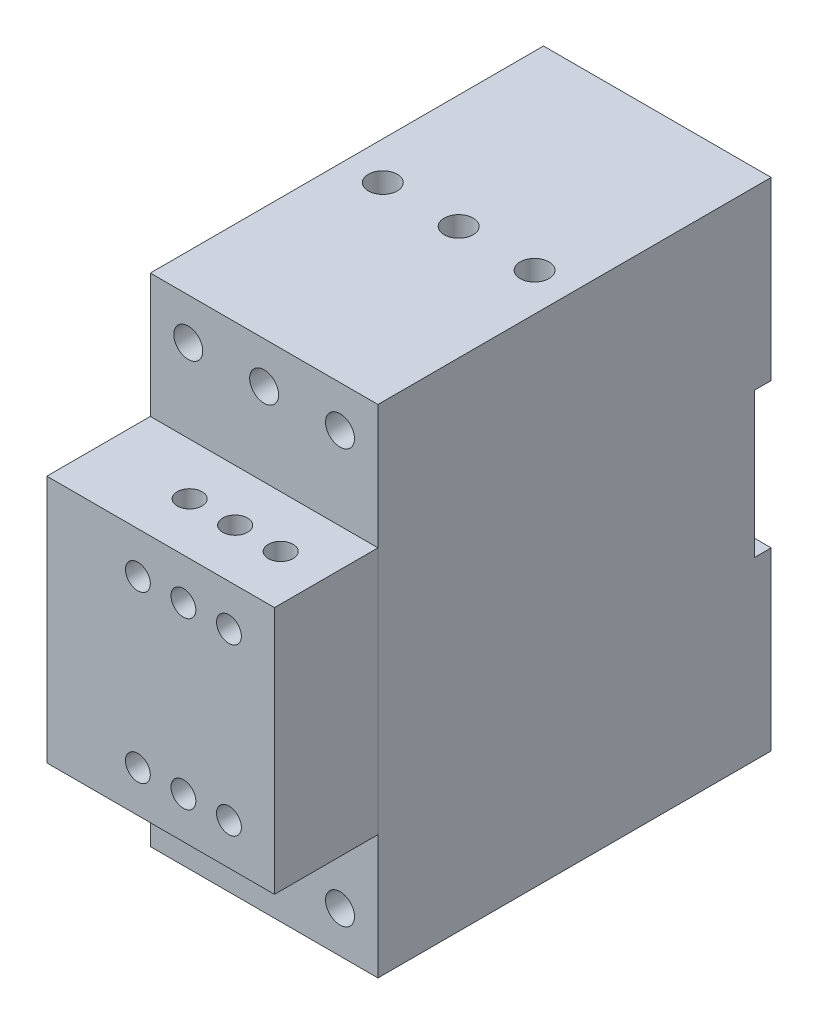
ISO-10303-21;
HEADER;
FILE_DESCRIPTION(('STEP AP214'),'2;1');
FILE_NAME('part.step','',(''),(''),'','','');
FILE_SCHEMA(('AUTOMOTIVE_DESIGN { 1 0 10303 214 1 1 1 1 }'));
ENDSEC;
DATA;
#1=APPLICATION_CONTEXT('core data for automotive mechanical design processes');
#2=APPLICATION_PROTOCOL_DEFINITION('international standard','automotive_design',2000,#1);
#3=PRODUCT_CONTEXT('',#1,'mechanical');
#4=PRODUCT('Part','Part','',(#3));
#5=PRODUCT_RELATED_PRODUCT_CATEGORY('part','',(#4));
#6=PRODUCT_DEFINITION_FORMATION('','',#4);
#7=PRODUCT_DEFINITION_CONTEXT('part definition',#1,'design');
#8=PRODUCT_DEFINITION('design','',#6,#7);
#9=PRODUCT_DEFINITION_SHAPE('','',#8);
#10=(LENGTH_UNIT() NAMED_UNIT(*) SI_UNIT(.MILLI.,.METRE.));
#11=(NAMED_UNIT(*) PLANE_ANGLE_UNIT() SI_UNIT($,.RADIAN.));
#12=(NAMED_UNIT(*) SI_UNIT($,.STERADIAN.) SOLID_ANGLE_UNIT());
#13=UNCERTAINTY_MEASURE_WITH_UNIT(LENGTH_MEASURE(1.E-05),#10,'distance_accuracy_value','');
#14=(GEOMETRIC_REPRESENTATION_CONTEXT(3) GLOBAL_UNCERTAINTY_ASSIGNED_CONTEXT((#13)) GLOBAL_UNIT_ASSIGNED_CONTEXT((#10,
#11,#12)) REPRESENTATION_CONTEXT('',''));
#15=CARTESIAN_POINT('',(0.,0.,0.));
#16=DIRECTION('',(0.,0.,1.));
#17=DIRECTION('',(1.,0.,0.));
#18=AXIS2_PLACEMENT_3D('',#15,#16,#17);
#19=CARTESIAN_POINT('',(0.,30.,91.));
#20=DIRECTION('',(0.,0.,1.));
#21=DIRECTION('',(1.,0.,0.));
#22=AXIS2_PLACEMENT_3D('',#19,#20,#21);
#23=PLANE('',#22);
#24=DIRECTION('',(-1.,0.,0.));
#25=VECTOR('',#24,1.);
#26=CARTESIAN_POINT('',(55.,-60.,91.));
#27=LINE('',#26,#25);
#28=CARTESIAN_POINT('',(55.,-60.,91.));
#29=VERTEX_POINT('',#28);
#30=CARTESIAN_POINT('',(0.,-60.,91.));
#31=VERTEX_POINT('',#30);
#32=EDGE_CURVE('E610',#29,#31,#27,.T.);
#33=ORIENTED_EDGE('',*,*,#32,.F.);
#34=DIRECTION('',(0.,-1.,0.));
#35=VECTOR('',#34,1.);
#36=CARTESIAN_POINT('',(55.,60.,91.));
#37=LINE('',#36,#35);
#38=CARTESIAN_POINT('',(55.,60.,91.));
#39=VERTEX_POINT('',#38);
#40=EDGE_CURVE('E159',#39,#29,#37,.T.);
#41=ORIENTED_EDGE('',*,*,#40,.F.);
#42=DIRECTION('',(-1.,0.,0.));
#43=VECTOR('',#42,1.);
#44=CARTESIAN_POINT('',(55.,60.,91.));
#45=LINE('',#44,#43);
#46=CARTESIAN_POINT('',(0.,60.,91.));
#47=VERTEX_POINT('',#46);
#48=EDGE_CURVE('E137',#39,#47,#45,.T.);
#49=ORIENTED_EDGE('',*,*,#48,.T.);
#50=DIRECTION('',(0.,-1.,0.));
#51=VECTOR('',#50,1.);
#52=CARTESIAN_POINT('',(0.,60.,91.));
#53=LINE('',#52,#51);
#54=EDGE_CURVE('E141',#47,#31,#53,.T.);
#55=ORIENTED_EDGE('',*,*,#54,.T.);
#56=EDGE_LOOP('',(#33,#41,#49,#55));
#57=FACE_BOUND('',#56,.T.);
#58=CARTESIAN_POINT('',(27.5,-50.,91.));
#59=DIRECTION('',(0.,0.,-1.));
#60=DIRECTION('',(1.,0.,0.));
#61=AXIS2_PLACEMENT_3D('',#58,#59,#60);
#62=CIRCLE('',#61,3.5);
#63=CARTESIAN_POINT('',(31.,-50.,91.));
#64=VERTEX_POINT('',#63);
#65=EDGE_CURVE('E209',#64,#64,#62,.T.);
#66=ORIENTED_EDGE('',*,*,#65,.T.);
#67=EDGE_LOOP('',(#66));
#68=FACE_BOUND('',#67,.T.);
#69=CARTESIAN_POINT('',(45.8333333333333,-50.,91.));
#70=DIRECTION('',(0.,0.,-1.));
#71=DIRECTION('',(1.,0.,0.));
#72=AXIS2_PLACEMENT_3D('',#69,#70,#71);
#73=CIRCLE('',#72,3.5);
#74=CARTESIAN_POINT('',(49.3333333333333,-50.,91.));
#75=VERTEX_POINT('',#74);
#76=EDGE_CURVE('E203',#75,#75,#73,.T.);
#77=ORIENTED_EDGE('',*,*,#76,.T.);
#78=EDGE_LOOP('',(#77));
#79=FACE_BOUND('',#78,.T.);
#80=CARTESIAN_POINT('',(9.16666666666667,-50.,91.));
#81=DIRECTION('',(0.,0.,-1.));
#82=DIRECTION('',(1.,0.,0.));
#83=AXIS2_PLACEMENT_3D('',#80,#81,#82);
#84=CIRCLE('',#83,3.50000000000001);
#85=CARTESIAN_POINT('',(12.6666666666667,-50.,91.));
#86=VERTEX_POINT('',#85);
#87=EDGE_CURVE('E215',#86,#86,#84,.T.);
#88=ORIENTED_EDGE('',*,*,#87,.T.);
#89=EDGE_LOOP('',(#88));
#90=FACE_BOUND('',#89,.T.);
#91=CARTESIAN_POINT('',(9.16666666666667,50.,91.));
#92=DIRECTION('',(0.,0.,1.));
#93=DIRECTION('',(1.,0.,0.));
#94=AXIS2_PLACEMENT_3D('',#91,#92,#93);
#95=CIRCLE('',#94,3.50000000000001);
#96=CARTESIAN_POINT('',(12.6666666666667,50.,91.));
#97=VERTEX_POINT('',#96);
#98=EDGE_CURVE('E179',#97,#97,#95,.T.);
#99=ORIENTED_EDGE('',*,*,#98,.F.);
#100=EDGE_LOOP('',(#99));
#101=FACE_BOUND('',#100,.T.);
#102=CARTESIAN_POINT('',(27.5,50.,91.));
#103=DIRECTION('',(0.,0.,1.));
#104=DIRECTION('',(1.,0.,0.));
#105=AXIS2_PLACEMENT_3D('',#102,#103,#104);
#106=CIRCLE('',#105,3.5);
#107=CARTESIAN_POINT('',(31.,50.,91.));
#108=VERTEX_POINT('',#107);
#109=EDGE_CURVE('E173',#108,#108,#106,.T.);
#110=ORIENTED_EDGE('',*,*,#109,.F.);
#111=EDGE_LOOP('',(#110));
#112=FACE_BOUND('',#111,.T.);
#113=CARTESIAN_POINT('',(45.8333333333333,50.,91.));
#114=DIRECTION('',(0.,0.,1.));
#115=DIRECTION('',(1.,0.,0.));
#116=AXIS2_PLACEMENT_3D('',#113,#114,#115);
#117=CIRCLE('',#116,3.5);
#118=CARTESIAN_POINT('',(49.3333333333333,50.,91.));
#119=VERTEX_POINT('',#118);
#120=EDGE_CURVE('E167',#119,#119,#117,.T.);
#121=ORIENTED_EDGE('',*,*,#120,.F.);
#122=EDGE_LOOP('',(#121));
#123=FACE_BOUND('',#122,.T.);
#124=ADVANCED_FACE('F49',(#57,#68,#79,#90,#101,#112,#123),#23,.T.);
#125=CARTESIAN_POINT('',(9.16666666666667,50.,86.));
#126=DIRECTION('',(0.,0.,1.));
#127=DIRECTION('',(1.,0.,0.));
#128=AXIS2_PLACEMENT_3D('',#125,#126,#127);
#129=PLANE('',#128);
#130=CARTESIAN_POINT('',(9.16666666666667,50.,86.));
#131=DIRECTION('',(0.,0.,1.));
#132=DIRECTION('',(1.,0.,0.));
#133=AXIS2_PLACEMENT_3D('',#130,#131,#132);
#134=CIRCLE('',#133,3.50000000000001);
#135=CARTESIAN_POINT('',(12.6666666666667,50.,86.));
#136=VERTEX_POINT('',#135);
#137=EDGE_CURVE('E176',#136,#136,#134,.T.);
#138=ORIENTED_EDGE('',*,*,#137,.T.);
#139=EDGE_LOOP('',(#138));
#140=FACE_BOUND('',#139,.T.);
#141=ADVANCED_FACE('F290',(#140),#129,.T.);
#142=CARTESIAN_POINT('',(9.16666666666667,50.,86.));
#143=DIRECTION('',(0.,0.,1.));
#144=DIRECTION('',(1.,0.,0.));
#145=AXIS2_PLACEMENT_3D('',#142,#143,#144);
#146=CYLINDRICAL_SURFACE('',#145,3.50000000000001);
#147=ORIENTED_EDGE('',*,*,#137,.F.);
#148=EDGE_LOOP('',(#147));
#149=FACE_BOUND('',#148,.T.);
#150=ORIENTED_EDGE('',*,*,#98,.T.);
#151=EDGE_LOOP('',(#150));
#152=FACE_BOUND('',#151,.T.);
#153=ADVANCED_FACE('F361',(#149,#152),#146,.F.);
#154=CARTESIAN_POINT('',(27.5,50.,86.));
#155=DIRECTION('',(0.,0.,1.));
#156=DIRECTION('',(1.,0.,0.));
#157=AXIS2_PLACEMENT_3D('',#154,#155,#156);
#158=PLANE('',#157);
#159=CARTESIAN_POINT('',(27.5,50.,86.));
#160=DIRECTION('',(0.,0.,1.));
#161=DIRECTION('',(1.,0.,0.));
#162=AXIS2_PLACEMENT_3D('',#159,#160,#161);
#163=CIRCLE('',#162,3.5);
#164=CARTESIAN_POINT('',(31.,50.,86.));
#165=VERTEX_POINT('',#164);
#166=EDGE_CURVE('E170',#165,#165,#163,.T.);
#167=ORIENTED_EDGE('',*,*,#166,.T.);
#168=EDGE_LOOP('',(#167));
#169=FACE_BOUND('',#168,.T.);
#170=ADVANCED_FACE('F358',(#169),#158,.T.);
#171=CARTESIAN_POINT('',(27.5,50.,86.));
#172=DIRECTION('',(0.,0.,1.));
#173=DIRECTION('',(1.,0.,0.));
#174=AXIS2_PLACEMENT_3D('',#171,#172,#173);
#175=CYLINDRICAL_SURFACE('',#174,3.5);
#176=ORIENTED_EDGE('',*,*,#166,.F.);
#177=EDGE_LOOP('',(#176));
#178=FACE_BOUND('',#177,.T.);
#179=ORIENTED_EDGE('',*,*,#109,.T.);
#180=EDGE_LOOP('',(#179));
#181=FACE_BOUND('',#180,.T.);
#182=ADVANCED_FACE('F348',(#178,#181),#175,.F.);
#183=CARTESIAN_POINT('',(45.8333333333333,50.,86.));
#184=DIRECTION('',(0.,0.,1.));
#185=DIRECTION('',(1.,0.,0.));
#186=AXIS2_PLACEMENT_3D('',#183,#184,#185);
#187=PLANE('',#186);
#188=CARTESIAN_POINT('',(45.8333333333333,50.,86.));
#189=DIRECTION('',(0.,0.,1.));
#190=DIRECTION('',(1.,0.,0.));
#191=AXIS2_PLACEMENT_3D('',#188,#189,#190);
#192=CIRCLE('',#191,3.5);
#193=CARTESIAN_POINT('',(49.3333333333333,50.,86.));
#194=VERTEX_POINT('',#193);
#195=EDGE_CURVE('E151',#194,#194,#192,.T.);
#196=ORIENTED_EDGE('',*,*,#195,.T.);
#197=EDGE_LOOP('',(#196));
#198=FACE_BOUND('',#197,.T.);
#199=ADVANCED_FACE('F339',(#198),#187,.T.);
#200=CARTESIAN_POINT('',(45.8333333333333,50.,86.));
#201=DIRECTION('',(0.,0.,1.));
#202=DIRECTION('',(1.,0.,0.));
#203=AXIS2_PLACEMENT_3D('',#200,#201,#202);
#204=CYLINDRICAL_SURFACE('',#203,3.5);
#205=ORIENTED_EDGE('',*,*,#195,.F.);
#206=EDGE_LOOP('',(#205));
#207=FACE_BOUND('',#206,.T.);
#208=ORIENTED_EDGE('',*,*,#120,.T.);
#209=EDGE_LOOP('',(#208));
#210=FACE_BOUND('',#209,.T.);
#211=ADVANCED_FACE('F337',(#207,#210),#204,.F.);
#212=CARTESIAN_POINT('',(45.8333333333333,-55.,44.));
#213=DIRECTION('',(0.,-1.,0.));
#214=DIRECTION('',(0.,0.,1.));
#215=AXIS2_PLACEMENT_3D('',#212,#213,#214);
#216=PLANE('',#215);
#217=CARTESIAN_POINT('',(45.8333333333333,-55.,44.));
#218=DIRECTION('',(0.,1.,0.));
#219=DIRECTION('',(0.,0.,1.));
#220=AXIS2_PLACEMENT_3D('',#217,#218,#219);
#221=CIRCLE('',#220,3.5);
#222=CARTESIAN_POINT('',(45.8333333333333,-55.,47.5));
#223=VERTEX_POINT('',#222);
#224=EDGE_CURVE('E53',#223,#223,#221,.T.);
#225=ORIENTED_EDGE('',*,*,#224,.F.);
#226=EDGE_LOOP('',(#225));
#227=FACE_BOUND('',#226,.T.);
#228=ADVANCED_FACE('F248',(#227),#216,.T.);
#229=CARTESIAN_POINT('',(9.16666666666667,-55.,44.));
#230=DIRECTION('',(0.,-1.,0.));
#231=DIRECTION('',(0.,0.,1.));
#232=AXIS2_PLACEMENT_3D('',#229,#230,#231);
#233=PLANE('',#232);
#234=CARTESIAN_POINT('',(9.16666666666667,-55.,44.));
#235=DIRECTION('',(0.,1.,0.));
#236=DIRECTION('',(0.,0.,1.));
#237=AXIS2_PLACEMENT_3D('',#234,#235,#236);
#238=CIRCLE('',#237,3.50000000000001);
#239=CARTESIAN_POINT('',(9.16666666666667,-55.,47.5));
#240=VERTEX_POINT('',#239);
#241=EDGE_CURVE('E218',#240,#240,#238,.T.);
#242=ORIENTED_EDGE('',*,*,#241,.F.);
#243=EDGE_LOOP('',(#242));
#244=FACE_BOUND('',#243,.T.);
#245=ADVANCED_FACE('F239',(#244),#233,.T.);
#246=CARTESIAN_POINT('',(27.5,-55.,44.));
#247=DIRECTION('',(0.,-1.,0.));
#248=DIRECTION('',(0.,0.,1.));
#249=AXIS2_PLACEMENT_3D('',#246,#247,#248);
#250=PLANE('',#249);
#251=CARTESIAN_POINT('',(27.5,-55.,44.));
#252=DIRECTION('',(0.,1.,0.));
#253=DIRECTION('',(0.,0.,1.));
#254=AXIS2_PLACEMENT_3D('',#251,#252,#253);
#255=CIRCLE('',#254,3.5);
#256=CARTESIAN_POINT('',(27.5,-55.,47.5));
#257=VERTEX_POINT('',#256);
#258=EDGE_CURVE('E224',#257,#257,#255,.T.);
#259=ORIENTED_EDGE('',*,*,#258,.F.);
#260=EDGE_LOOP('',(#259));
#261=FACE_BOUND('',#260,.T.);
#262=ADVANCED_FACE('F236',(#261),#250,.T.);
#263=CARTESIAN_POINT('',(9.16666666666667,55.,44.));
#264=DIRECTION('',(0.,1.,0.));
#265=DIRECTION('',(0.,0.,1.));
#266=AXIS2_PLACEMENT_3D('',#263,#264,#265);
#267=PLANE('',#266);
#268=CARTESIAN_POINT('',(9.16666666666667,55.,44.));
#269=DIRECTION('',(0.,1.,0.));
#270=DIRECTION('',(0.,0.,1.));
#271=AXIS2_PLACEMENT_3D('',#268,#269,#270);
#272=CIRCLE('',#271,3.50000000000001);
#273=CARTESIAN_POINT('',(9.16666666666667,55.,47.5));
#274=VERTEX_POINT('',#273);
#275=EDGE_CURVE('E182',#274,#274,#272,.T.);
#276=ORIENTED_EDGE('',*,*,#275,.T.);
#277=EDGE_LOOP('',(#276));
#278=FACE_BOUND('',#277,.T.);
#279=ADVANCED_FACE('F238',(#278),#267,.T.);
#280=CARTESIAN_POINT('',(27.5,55.,44.));
#281=DIRECTION('',(0.,1.,0.));
#282=DIRECTION('',(0.,0.,1.));
#283=AXIS2_PLACEMENT_3D('',#280,#281,#282);
#284=PLANE('',#283);
#285=CARTESIAN_POINT('',(27.5,55.,44.));
#286=DIRECTION('',(0.,1.,0.));
#287=DIRECTION('',(0.,0.,1.));
#288=AXIS2_PLACEMENT_3D('',#285,#286,#287);
#289=CIRCLE('',#288,3.5);
#290=CARTESIAN_POINT('',(27.5,55.,47.5));
#291=VERTEX_POINT('',#290);
#292=EDGE_CURVE('E188',#291,#291,#289,.T.);
#293=ORIENTED_EDGE('',*,*,#292,.T.);
#294=EDGE_LOOP('',(#293));
#295=FACE_BOUND('',#294,.T.);
#296=ADVANCED_FACE('F245',(#295),#284,.T.);
#297=CARTESIAN_POINT('',(45.8333333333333,55.,44.));
#298=DIRECTION('',(0.,1.,0.));
#299=DIRECTION('',(0.,0.,1.));
#300=AXIS2_PLACEMENT_3D('',#297,#298,#299);
#301=PLANE('',#300);
#302=CARTESIAN_POINT('',(45.8333333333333,55.,44.));
#303=DIRECTION('',(0.,1.,0.));
#304=DIRECTION('',(0.,0.,1.));
#305=AXIS2_PLACEMENT_3D('',#302,#303,#304);
#306=CIRCLE('',#305,3.5);
#307=CARTESIAN_POINT('',(45.8333333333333,55.,47.5));
#308=VERTEX_POINT('',#307);
#309=EDGE_CURVE('E194',#308,#308,#306,.T.);
#310=ORIENTED_EDGE('',*,*,#309,.T.);
#311=EDGE_LOOP('',(#310));
#312=FACE_BOUND('',#311,.T.);
#313=ADVANCED_FACE('F295',(#312),#301,.T.);
#314=CARTESIAN_POINT('',(45.8333333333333,-55.,44.));
#315=DIRECTION('',(0.,-1.,0.));
#316=DIRECTION('',(0.,0.,-1.));
#317=AXIS2_PLACEMENT_3D('',#314,#315,#316);
#318=CYLINDRICAL_SURFACE('',#317,3.5);
#319=ORIENTED_EDGE('',*,*,#224,.T.);
#320=EDGE_LOOP('',(#319));
#321=FACE_BOUND('',#320,.T.);
#322=CARTESIAN_POINT('',(45.8333333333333,-60.,44.));
#323=DIRECTION('',(0.,1.,0.));
#324=DIRECTION('',(0.,0.,1.));
#325=AXIS2_PLACEMENT_3D('',#322,#323,#324);
#326=CIRCLE('',#325,3.5);
#327=CARTESIAN_POINT('',(45.8333333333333,-60.,47.5));
#328=VERTEX_POINT('',#327);
#329=EDGE_CURVE('E13',#328,#328,#326,.T.);
#330=ORIENTED_EDGE('',*,*,#329,.F.);
#331=EDGE_LOOP('',(#330));
#332=FACE_BOUND('',#331,.T.);
#333=ADVANCED_FACE('F271',(#321,#332),#318,.F.);
#334=CARTESIAN_POINT('',(9.16666666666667,-55.,44.));
#335=DIRECTION('',(0.,-1.,0.));
#336=DIRECTION('',(0.,0.,-1.));
#337=AXIS2_PLACEMENT_3D('',#334,#335,#336);
#338=CYLINDRICAL_SURFACE('',#337,3.50000000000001);
#339=ORIENTED_EDGE('',*,*,#241,.T.);
#340=EDGE_LOOP('',(#339));
#341=FACE_BOUND('',#340,.T.);
#342=CARTESIAN_POINT('',(9.16666666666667,-60.,44.));
#343=DIRECTION('',(0.,1.,0.));
#344=DIRECTION('',(0.,0.,1.));
#345=AXIS2_PLACEMENT_3D('',#342,#343,#344);
#346=CIRCLE('',#345,3.50000000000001);
#347=CARTESIAN_POINT('',(9.16666666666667,-60.,47.5));
#348=VERTEX_POINT('',#347);
#349=EDGE_CURVE('E221',#348,#348,#346,.T.);
#350=ORIENTED_EDGE('',*,*,#349,.F.);
#351=EDGE_LOOP('',(#350));
#352=FACE_BOUND('',#351,.T.);
#353=ADVANCED_FACE('F269',(#341,#352),#338,.F.);
#354=CARTESIAN_POINT('',(27.5,-55.,44.));
#355=DIRECTION('',(0.,-1.,0.));
#356=DIRECTION('',(0.,0.,-1.));
#357=AXIS2_PLACEMENT_3D('',#354,#355,#356);
#358=CYLINDRICAL_SURFACE('',#357,3.5);
#359=ORIENTED_EDGE('',*,*,#258,.T.);
#360=EDGE_LOOP('',(#359));
#361=FACE_BOUND('',#360,.T.);
#362=CARTESIAN_POINT('',(27.5,-60.,44.));
#363=DIRECTION('',(0.,1.,0.));
#364=DIRECTION('',(0.,0.,1.));
#365=AXIS2_PLACEMENT_3D('',#362,#363,#364);
#366=CIRCLE('',#365,3.5);
#367=CARTESIAN_POINT('',(27.5,-60.,47.5));
#368=VERTEX_POINT('',#367);
#369=EDGE_CURVE('E227',#368,#368,#366,.T.);
#370=ORIENTED_EDGE('',*,*,#369,.F.);
#371=EDGE_LOOP('',(#370));
#372=FACE_BOUND('',#371,.T.);
#373=ADVANCED_FACE('F233',(#361,#372),#358,.F.);
#374=CARTESIAN_POINT('',(9.16666666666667,55.,44.));
#375=DIRECTION('',(0.,1.,0.));
#376=DIRECTION('',(0.,0.,1.));
#377=AXIS2_PLACEMENT_3D('',#374,#375,#376);
#378=CYLINDRICAL_SURFACE('',#377,3.50000000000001);
#379=ORIENTED_EDGE('',*,*,#275,.F.);
#380=EDGE_LOOP('',(#379));
#381=FACE_BOUND('',#380,.T.);
#382=CARTESIAN_POINT('',(9.16666666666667,60.,44.));
#383=DIRECTION('',(0.,1.,0.));
#384=DIRECTION('',(0.,0.,1.));
#385=AXIS2_PLACEMENT_3D('',#382,#383,#384);
#386=CIRCLE('',#385,3.50000000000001);
#387=CARTESIAN_POINT('',(9.16666666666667,60.,47.5));
#388=VERTEX_POINT('',#387);
#389=EDGE_CURVE('E185',#388,#388,#386,.T.);
#390=ORIENTED_EDGE('',*,*,#389,.T.);
#391=EDGE_LOOP('',(#390));
#392=FACE_BOUND('',#391,.T.);
#393=ADVANCED_FACE('F274',(#381,#392),#378,.F.);
#394=CARTESIAN_POINT('',(27.5,55.,44.));
#395=DIRECTION('',(0.,1.,0.));
#396=DIRECTION('',(0.,0.,1.));
#397=AXIS2_PLACEMENT_3D('',#394,#395,#396);
#398=CYLINDRICAL_SURFACE('',#397,3.5);
#399=ORIENTED_EDGE('',*,*,#292,.F.);
#400=EDGE_LOOP('',(#399));
#401=FACE_BOUND('',#400,.T.);
#402=CARTESIAN_POINT('',(27.5,60.,44.));
#403=DIRECTION('',(0.,1.,0.));
#404=DIRECTION('',(0.,0.,1.));
#405=AXIS2_PLACEMENT_3D('',#402,#403,#404);
#406=CIRCLE('',#405,3.5);
#407=CARTESIAN_POINT('',(27.5,60.,47.5));
#408=VERTEX_POINT('',#407);
#409=EDGE_CURVE('E191',#408,#408,#406,.T.);
#410=ORIENTED_EDGE('',*,*,#409,.T.);
#411=EDGE_LOOP('',(#410));
#412=FACE_BOUND('',#411,.T.);
#413=ADVANCED_FACE('F278',(#401,#412),#398,.F.);
#414=CARTESIAN_POINT('',(45.8333333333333,55.,44.));
#415=DIRECTION('',(0.,1.,0.));
#416=DIRECTION('',(0.,0.,1.));
#417=AXIS2_PLACEMENT_3D('',#414,#415,#416);
#418=CYLINDRICAL_SURFACE('',#417,3.5);
#419=ORIENTED_EDGE('',*,*,#309,.F.);
#420=EDGE_LOOP('',(#419));
#421=FACE_BOUND('',#420,.T.);
#422=CARTESIAN_POINT('',(45.8333333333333,60.,44.));
#423=DIRECTION('',(0.,1.,0.));
#424=DIRECTION('',(0.,0.,1.));
#425=AXIS2_PLACEMENT_3D('',#422,#423,#424);
#426=CIRCLE('',#425,3.5);
#427=CARTESIAN_POINT('',(45.8333333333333,60.,47.5));
#428=VERTEX_POINT('',#427);
#429=EDGE_CURVE('E197',#428,#428,#426,.T.);
#430=ORIENTED_EDGE('',*,*,#429,.T.);
#431=EDGE_LOOP('',(#430));
#432=FACE_BOUND('',#431,.T.);
#433=ADVANCED_FACE('F284',(#421,#432),#418,.F.);
#434=CARTESIAN_POINT('',(55.,-60.,91.));
#435=DIRECTION('',(0.,1.,0.));
#436=DIRECTION('',(0.,0.,1.));
#437=AXIS2_PLACEMENT_3D('',#434,#435,#436);
#438=PLANE('',#437);
#439=ORIENTED_EDGE('',*,*,#369,.T.);
#440=EDGE_LOOP('',(#439));
#441=FACE_BOUND('',#440,.T.);
#442=DIRECTION('',(0.,0.,-1.));
#443=VECTOR('',#442,1.);
#444=CARTESIAN_POINT('',(0.,-60.,91.));
#445=LINE('',#444,#443);
#446=CARTESIAN_POINT('',(0.,-60.,-4.));
#447=VERTEX_POINT('',#446);
#448=EDGE_CURVE('E143',#31,#447,#445,.T.);
#449=ORIENTED_EDGE('',*,*,#448,.T.);
#450=DIRECTION('',(-1.,0.,0.));
#451=VECTOR('',#450,1.);
#452=CARTESIAN_POINT('',(55.,-60.,-4.));
#453=LINE('',#452,#451);
#454=CARTESIAN_POINT('',(55.,-60.,-4.));
#455=VERTEX_POINT('',#454);
#456=EDGE_CURVE('E607',#455,#447,#453,.T.);
#457=ORIENTED_EDGE('',*,*,#456,.F.);
#458=DIRECTION('',(0.,0.,-1.));
#459=VECTOR('',#458,1.);
#460=CARTESIAN_POINT('',(55.,-60.,91.));
#461=LINE('',#460,#459);
#462=EDGE_CURVE('E157',#29,#455,#461,.T.);
#463=ORIENTED_EDGE('',*,*,#462,.F.);
#464=ORIENTED_EDGE('',*,*,#32,.T.);
#465=EDGE_LOOP('',(#449,#457,#463,#464));
#466=FACE_BOUND('',#465,.T.);
#467=ORIENTED_EDGE('',*,*,#349,.T.);
#468=EDGE_LOOP('',(#467));
#469=FACE_BOUND('',#468,.T.);
#470=ORIENTED_EDGE('',*,*,#329,.T.);
#471=EDGE_LOOP('',(#470));
#472=FACE_BOUND('',#471,.T.);
#473=ADVANCED_FACE('F299',(#441,#466,#469,#472),#438,.F.);
#474=CARTESIAN_POINT('',(55.,-60.,-4.));
#475=DIRECTION('',(0.,0.,1.));
#476=DIRECTION('',(1.,0.,0.));
#477=AXIS2_PLACEMENT_3D('',#474,#475,#476);
#478=PLANE('',#477);
#479=DIRECTION('',(0.,1.,0.));
#480=VECTOR('',#479,1.);
#481=CARTESIAN_POINT('',(0.,-60.,-4.));
#482=LINE('',#481,#480);
#483=CARTESIAN_POINT('',(0.,-17.5,-4.));
#484=VERTEX_POINT('',#483);
#485=EDGE_CURVE('E612',#447,#484,#482,.T.);
#486=ORIENTED_EDGE('',*,*,#485,.T.);
#487=DIRECTION('',(-1.,0.,0.));
#488=VECTOR('',#487,1.);
#489=CARTESIAN_POINT('',(55.,-17.5,-4.));
#490=LINE('',#489,#488);
#491=CARTESIAN_POINT('',(55.,-17.5,-4.));
#492=VERTEX_POINT('',#491);
#493=EDGE_CURVE('E614',#492,#484,#490,.T.);
#494=ORIENTED_EDGE('',*,*,#493,.F.);
#495=DIRECTION('',(0.,1.,0.));
#496=VECTOR('',#495,1.);
#497=CARTESIAN_POINT('',(55.,-60.,-4.));
#498=LINE('',#497,#496);
#499=EDGE_CURVE('E154',#455,#492,#498,.T.);
#500=ORIENTED_EDGE('',*,*,#499,.F.);
#501=ORIENTED_EDGE('',*,*,#456,.T.);
#502=EDGE_LOOP('',(#486,#494,#500,#501));
#503=FACE_BOUND('',#502,.T.);
#504=ADVANCED_FACE('F468',(#503),#478,.F.);
#505=CARTESIAN_POINT('',(55.,-17.5,-4.));
#506=DIRECTION('',(0.,-1.,0.));
#507=DIRECTION('',(0.,0.,-1.));
#508=AXIS2_PLACEMENT_3D('',#505,#506,#507);
#509=PLANE('',#508);
#510=DIRECTION('',(0.,0.,1.));
#511=VECTOR('',#510,1.);
#512=CARTESIAN_POINT('',(0.,-17.5,-4.));
#513=LINE('',#512,#511);
#514=CARTESIAN_POINT('',(0.,-17.5,0.));
#515=VERTEX_POINT('',#514);
#516=EDGE_CURVE('E105',#484,#515,#513,.T.);
#517=ORIENTED_EDGE('',*,*,#516,.T.);
#518=DIRECTION('',(-1.,0.,0.));
#519=VECTOR('',#518,1.);
#520=CARTESIAN_POINT('',(55.,-17.5,0.));
#521=LINE('',#520,#519);
#522=CARTESIAN_POINT('',(55.,-17.5,0.));
#523=VERTEX_POINT('',#522);
#524=EDGE_CURVE('E155',#523,#515,#521,.T.);
#525=ORIENTED_EDGE('',*,*,#524,.F.);
#526=DIRECTION('',(0.,0.,1.));
#527=VECTOR('',#526,1.);
#528=CARTESIAN_POINT('',(55.,-17.5,-4.));
#529=LINE('',#528,#527);
#530=EDGE_CURVE('E152',#492,#523,#529,.T.);
#531=ORIENTED_EDGE('',*,*,#530,.F.);
#532=ORIENTED_EDGE('',*,*,#493,.T.);
#533=EDGE_LOOP('',(#517,#525,#531,#532));
#534=FACE_BOUND('',#533,.T.);
#535=ADVANCED_FACE('F353',(#534),#509,.F.);
#536=CARTESIAN_POINT('',(55.,-17.5,0.));
#537=DIRECTION('',(0.,0.,1.));
#538=DIRECTION('',(1.,0.,0.));
#539=AXIS2_PLACEMENT_3D('',#536,#537,#538);
#540=PLANE('',#539);
#541=DIRECTION('',(0.,1.,0.));
#542=VECTOR('',#541,1.);
#543=CARTESIAN_POINT('',(0.,-17.5,0.));
#544=LINE('',#543,#542);
#545=CARTESIAN_POINT('',(0.,17.5,0.));
#546=VERTEX_POINT('',#545);
#547=EDGE_CURVE('E148',#515,#546,#544,.T.);
#548=ORIENTED_EDGE('',*,*,#547,.T.);
#549=DIRECTION('',(-1.,0.,0.));
#550=VECTOR('',#549,1.);
#551=CARTESIAN_POINT('',(55.,17.5,0.));
#552=LINE('',#551,#550);
#553=CARTESIAN_POINT('',(55.,17.5,0.));
#554=VERTEX_POINT('',#553);
#555=EDGE_CURVE('E624',#554,#546,#552,.T.);
#556=ORIENTED_EDGE('',*,*,#555,.F.);
#557=DIRECTION('',(0.,1.,0.));
#558=VECTOR('',#557,1.);
#559=CARTESIAN_POINT('',(55.,-17.5,0.));
#560=LINE('',#559,#558);
#561=EDGE_CURVE('E165',#523,#554,#560,.T.);
#562=ORIENTED_EDGE('',*,*,#561,.F.);
#563=ORIENTED_EDGE('',*,*,#524,.T.);
#564=EDGE_LOOP('',(#548,#556,#562,#563));
#565=FACE_BOUND('',#564,.T.);
#566=ADVANCED_FACE('F450',(#565),#540,.F.);
#567=CARTESIAN_POINT('',(55.,17.5,0.));
#568=DIRECTION('',(0.,1.,0.));
#569=DIRECTION('',(0.,0.,1.));
#570=AXIS2_PLACEMENT_3D('',#567,#568,#569);
#571=PLANE('',#570);
#572=DIRECTION('',(0.,0.,-1.));
#573=VECTOR('',#572,1.);
#574=CARTESIAN_POINT('',(0.,17.5,0.));
#575=LINE('',#574,#573);
#576=CARTESIAN_POINT('',(0.,17.5,-4.));
#577=VERTEX_POINT('',#576);
#578=EDGE_CURVE('E66',#546,#577,#575,.T.);
#579=ORIENTED_EDGE('',*,*,#578,.T.);
#580=DIRECTION('',(-1.,0.,0.));
#581=VECTOR('',#580,1.);
#582=CARTESIAN_POINT('',(55.,17.5,-4.));
#583=LINE('',#582,#581);
#584=CARTESIAN_POINT('',(55.,17.5,-4.));
#585=VERTEX_POINT('',#584);
#586=EDGE_CURVE('E128',#585,#577,#583,.T.);
#587=ORIENTED_EDGE('',*,*,#586,.F.);
#588=DIRECTION('',(0.,0.,-1.));
#589=VECTOR('',#588,1.);
#590=CARTESIAN_POINT('',(55.,17.5,0.));
#591=LINE('',#590,#589);
#592=EDGE_CURVE('E94',#554,#585,#591,.T.);
#593=ORIENTED_EDGE('',*,*,#592,.F.);
#594=ORIENTED_EDGE('',*,*,#555,.T.);
#595=EDGE_LOOP('',(#579,#587,#593,#594));
#596=FACE_BOUND('',#595,.T.);
#597=ADVANCED_FACE('F442',(#596),#571,.F.);
#598=CARTESIAN_POINT('',(55.,17.5,-4.));
#599=DIRECTION('',(0.,0.,1.));
#600=DIRECTION('',(1.,0.,0.));
#601=AXIS2_PLACEMENT_3D('',#598,#599,#600);
#602=PLANE('',#601);
#603=DIRECTION('',(0.,1.,0.));
#604=VECTOR('',#603,1.);
#605=CARTESIAN_POINT('',(0.,17.5,-4.));
#606=LINE('',#605,#604);
#607=CARTESIAN_POINT('',(0.,60.,-4.));
#608=VERTEX_POINT('',#607);
#609=EDGE_CURVE('E122',#577,#608,#606,.T.);
#610=ORIENTED_EDGE('',*,*,#609,.T.);
#611=DIRECTION('',(-1.,0.,0.));
#612=VECTOR('',#611,1.);
#613=CARTESIAN_POINT('',(55.,60.,-4.));
#614=LINE('',#613,#612);
#615=CARTESIAN_POINT('',(55.,60.,-4.));
#616=VERTEX_POINT('',#615);
#617=EDGE_CURVE('E126',#616,#608,#614,.T.);
#618=ORIENTED_EDGE('',*,*,#617,.F.);
#619=DIRECTION('',(0.,1.,0.));
#620=VECTOR('',#619,1.);
#621=CARTESIAN_POINT('',(55.,17.5,-4.));
#622=LINE('',#621,#620);
#623=EDGE_CURVE('E162',#585,#616,#622,.T.);
#624=ORIENTED_EDGE('',*,*,#623,.F.);
#625=ORIENTED_EDGE('',*,*,#586,.T.);
#626=EDGE_LOOP('',(#610,#618,#624,#625));
#627=FACE_BOUND('',#626,.T.);
#628=ADVANCED_FACE('F124',(#627),#602,.F.);
#629=CARTESIAN_POINT('',(55.,60.,-4.));
#630=DIRECTION('',(0.,-1.,0.));
#631=DIRECTION('',(0.,0.,-1.));
#632=AXIS2_PLACEMENT_3D('',#629,#630,#631);
#633=PLANE('',#632);
#634=ORIENTED_EDGE('',*,*,#429,.F.);
#635=EDGE_LOOP('',(#634));
#636=FACE_BOUND('',#635,.T.);
#637=ORIENTED_EDGE('',*,*,#409,.F.);
#638=EDGE_LOOP('',(#637));
#639=FACE_BOUND('',#638,.T.);
#640=ORIENTED_EDGE('',*,*,#389,.F.);
#641=EDGE_LOOP('',(#640));
#642=FACE_BOUND('',#641,.T.);
#643=DIRECTION('',(0.,0.,1.));
#644=VECTOR('',#643,1.);
#645=CARTESIAN_POINT('',(0.,60.,-4.));
#646=LINE('',#645,#644);
#647=EDGE_CURVE('E130',#608,#47,#646,.T.);
#648=ORIENTED_EDGE('',*,*,#647,.T.);
#649=ORIENTED_EDGE('',*,*,#48,.F.);
#650=DIRECTION('',(0.,0.,1.));
#651=VECTOR('',#650,1.);
#652=CARTESIAN_POINT('',(55.,60.,-4.));
#653=LINE('',#652,#651);
#654=EDGE_CURVE('E136',#616,#39,#653,.T.);
#655=ORIENTED_EDGE('',*,*,#654,.F.);
#656=ORIENTED_EDGE('',*,*,#617,.T.);
#657=EDGE_LOOP('',(#648,#649,#655,#656));
#658=FACE_BOUND('',#657,.T.);
#659=ADVANCED_FACE('F133',(#636,#639,#642,#658),#633,.F.);
#660=CARTESIAN_POINT('',(0.,17.5,0.));
#661=DIRECTION('',(-1.,0.,0.));
#662=DIRECTION('',(0.,0.,1.));
#663=AXIS2_PLACEMENT_3D('',#660,#661,#662);
#664=PLANE('',#663);
#665=ORIENTED_EDGE('',*,*,#448,.F.);
#666=ORIENTED_EDGE('',*,*,#54,.F.);
#667=ORIENTED_EDGE('',*,*,#647,.F.);
#668=ORIENTED_EDGE('',*,*,#609,.F.);
#669=ORIENTED_EDGE('',*,*,#578,.F.);
#670=ORIENTED_EDGE('',*,*,#547,.F.);
#671=ORIENTED_EDGE('',*,*,#516,.F.);
#672=ORIENTED_EDGE('',*,*,#485,.F.);
#673=EDGE_LOOP('',(#665,#666,#667,#668,#669,#670,#671,#672));
#674=FACE_BOUND('',#673,.T.);
#675=ADVANCED_FACE('F51',(#674),#664,.T.);
#676=CARTESIAN_POINT('',(55.,17.5,0.));
#677=DIRECTION('',(-1.,0.,0.));
#678=DIRECTION('',(0.,0.,1.));
#679=AXIS2_PLACEMENT_3D('',#676,#677,#678);
#680=PLANE('',#679);
#681=ORIENTED_EDGE('',*,*,#40,.T.);
#682=ORIENTED_EDGE('',*,*,#462,.T.);
#683=ORIENTED_EDGE('',*,*,#499,.T.);
#684=ORIENTED_EDGE('',*,*,#530,.T.);
#685=ORIENTED_EDGE('',*,*,#561,.T.);
#686=ORIENTED_EDGE('',*,*,#592,.T.);
#687=ORIENTED_EDGE('',*,*,#623,.T.);
#688=ORIENTED_EDGE('',*,*,#654,.T.);
#689=EDGE_LOOP('',(#681,#682,#683,#684,#685,#686,#687,#688));
#690=FACE_BOUND('',#689,.T.);
#691=ADVANCED_FACE('F256',(#690),#680,.F.);
#692=CARTESIAN_POINT('',(9.16666666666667,-50.,86.));
#693=DIRECTION('',(0.,0.,1.));
#694=DIRECTION('',(1.,0.,0.));
#695=AXIS2_PLACEMENT_3D('',#692,#693,#694);
#696=PLANE('',#695);
#697=CARTESIAN_POINT('',(9.16666666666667,-50.,86.));
#698=DIRECTION('',(0.,0.,-1.));
#699=DIRECTION('',(1.,0.,0.));
#700=AXIS2_PLACEMENT_3D('',#697,#698,#699);
#701=CIRCLE('',#700,3.50000000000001);
#702=CARTESIAN_POINT('',(12.6666666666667,-50.,86.));
#703=VERTEX_POINT('',#702);
#704=EDGE_CURVE('E212',#703,#703,#701,.T.);
#705=ORIENTED_EDGE('',*,*,#704,.F.);
#706=EDGE_LOOP('',(#705));
#707=FACE_BOUND('',#706,.T.);
#708=ADVANCED_FACE('F253',(#707),#696,.T.);
#709=CARTESIAN_POINT('',(9.16666666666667,-50.,86.));
#710=DIRECTION('',(0.,0.,1.));
#711=DIRECTION('',(1.,0.,0.));
#712=AXIS2_PLACEMENT_3D('',#709,#710,#711);
#713=CYLINDRICAL_SURFACE('',#712,3.50000000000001);
#714=ORIENTED_EDGE('',*,*,#704,.T.);
#715=EDGE_LOOP('',(#714));
#716=FACE_BOUND('',#715,.T.);
#717=ORIENTED_EDGE('',*,*,#87,.F.);
#718=EDGE_LOOP('',(#717));
#719=FACE_BOUND('',#718,.T.);
#720=ADVANCED_FACE('F255',(#716,#719),#713,.F.);
#721=CARTESIAN_POINT('',(27.5,-50.,86.));
#722=DIRECTION('',(0.,0.,1.));
#723=DIRECTION('',(1.,0.,0.));
#724=AXIS2_PLACEMENT_3D('',#721,#722,#723);
#725=PLANE('',#724);
#726=CARTESIAN_POINT('',(27.5,-50.,86.));
#727=DIRECTION('',(0.,0.,-1.));
#728=DIRECTION('',(1.,0.,0.));
#729=AXIS2_PLACEMENT_3D('',#726,#727,#728);
#730=CIRCLE('',#729,3.5);
#731=CARTESIAN_POINT('',(31.,-50.,86.));
#732=VERTEX_POINT('',#731);
#733=EDGE_CURVE('E206',#732,#732,#730,.T.);
#734=ORIENTED_EDGE('',*,*,#733,.F.);
#735=EDGE_LOOP('',(#734));
#736=FACE_BOUND('',#735,.T.);
#737=ADVANCED_FACE('F263',(#736),#725,.T.);
#738=CARTESIAN_POINT('',(27.5,-50.,86.));
#739=DIRECTION('',(0.,0.,1.));
#740=DIRECTION('',(1.,0.,0.));
#741=AXIS2_PLACEMENT_3D('',#738,#739,#740);
#742=CYLINDRICAL_SURFACE('',#741,3.5);
#743=ORIENTED_EDGE('',*,*,#733,.T.);
#744=EDGE_LOOP('',(#743));
#745=FACE_BOUND('',#744,.T.);
#746=ORIENTED_EDGE('',*,*,#65,.F.);
#747=EDGE_LOOP('',(#746));
#748=FACE_BOUND('',#747,.T.);
#749=ADVANCED_FACE('F311',(#745,#748),#742,.F.);
#750=CARTESIAN_POINT('',(45.8333333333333,-50.,86.));
#751=DIRECTION('',(0.,0.,1.));
#752=DIRECTION('',(1.,0.,0.));
#753=AXIS2_PLACEMENT_3D('',#750,#751,#752);
#754=PLANE('',#753);
#755=CARTESIAN_POINT('',(45.8333333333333,-50.,86.));
#756=DIRECTION('',(0.,0.,-1.));
#757=DIRECTION('',(1.,0.,0.));
#758=AXIS2_PLACEMENT_3D('',#755,#756,#757);
#759=CIRCLE('',#758,3.5);
#760=CARTESIAN_POINT('',(49.3333333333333,-50.,86.));
#761=VERTEX_POINT('',#760);
#762=EDGE_CURVE('E200',#761,#761,#759,.T.);
#763=ORIENTED_EDGE('',*,*,#762,.F.);
#764=EDGE_LOOP('',(#763));
#765=FACE_BOUND('',#764,.T.);
#766=ADVANCED_FACE('F307',(#765),#754,.T.);
#767=CARTESIAN_POINT('',(45.8333333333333,-50.,86.));
#768=DIRECTION('',(0.,0.,1.));
#769=DIRECTION('',(1.,0.,0.));
#770=AXIS2_PLACEMENT_3D('',#767,#768,#769);
#771=CYLINDRICAL_SURFACE('',#770,3.5);
#772=ORIENTED_EDGE('',*,*,#762,.T.);
#773=EDGE_LOOP('',(#772));
#774=FACE_BOUND('',#773,.T.);
#775=ORIENTED_EDGE('',*,*,#76,.F.);
#776=EDGE_LOOP('',(#775));
#777=FACE_BOUND('',#776,.T.);
#778=ADVANCED_FACE('F304',(#774,#777),#771,.F.);
#779=CLOSED_SHELL('',(#124,#141,#153,#170,#182,#199,#211,#228,#245,#262,#279,#296,#313,#333,
#353,#373,#393,#413,#433,#473,#504,#535,#566,#597,#628,#659,#675,#691,#708,#720,#737,#749,#766,#778));
#780=MANIFOLD_SOLID_BREP('B2',#779);
#781=CARTESIAN_POINT('',(0.,30.,91.));
#782=DIRECTION('',(0.,0.,1.));
#783=DIRECTION('',(1.,0.,0.));
#784=AXIS2_PLACEMENT_3D('',#781,#782,#783);
#785=PLANE('',#784);
#786=DIRECTION('',(0.,1.,0.));
#787=VECTOR('',#786,1.);
#788=CARTESIAN_POINT('',(0.,17.5,91.));
#789=LINE('',#788,#787);
#790=CARTESIAN_POINT('',(0.,-30.,91.));
#791=VERTEX_POINT('',#790);
#792=CARTESIAN_POINT('',(0.,30.,91.));
#793=VERTEX_POINT('',#792);
#794=EDGE_CURVE('E658',#791,#793,#789,.T.);
#795=ORIENTED_EDGE('',*,*,#794,.T.);
#796=DIRECTION('',(-1.,0.,0.));
#797=VECTOR('',#796,1.);
#798=CARTESIAN_POINT('',(55.,30.,91.));
#799=LINE('',#798,#797);
#800=CARTESIAN_POINT('',(55.,30.,91.));
#801=VERTEX_POINT('',#800);
#802=EDGE_CURVE('E695',#801,#793,#799,.T.);
#803=ORIENTED_EDGE('',*,*,#802,.F.);
#804=DIRECTION('',(0.,1.,0.));
#805=VECTOR('',#804,1.);
#806=CARTESIAN_POINT('',(55.,17.5,91.));
#807=LINE('',#806,#805);
#808=CARTESIAN_POINT('',(55.,-30.,91.));
#809=VERTEX_POINT('',#808);
#810=EDGE_CURVE('E653',#809,#801,#807,.T.);
#811=ORIENTED_EDGE('',*,*,#810,.F.);
#812=DIRECTION('',(-1.,0.,0.));
#813=VECTOR('',#812,1.);
#814=CARTESIAN_POINT('',(55.,-30.,91.));
#815=LINE('',#814,#813);
#816=EDGE_CURVE('E47',#809,#791,#815,.T.);
#817=ORIENTED_EDGE('',*,*,#816,.T.);
#818=EDGE_LOOP('',(#795,#803,#811,#817));
#819=FACE_BOUND('',#818,.T.);
#820=ADVANCED_FACE('F650',(#819),#785,.F.);
#821=CARTESIAN_POINT('',(55.,-30.,116.));
#822=DIRECTION('',(0.,1.,0.));
#823=DIRECTION('',(0.,0.,1.));
#824=AXIS2_PLACEMENT_3D('',#821,#822,#823);
#825=PLANE('',#824);
#826=CARTESIAN_POINT('',(33.,-30.,103.5));
#827=DIRECTION('',(0.,1.,0.));
#828=DIRECTION('',(0.,0.,1.));
#829=AXIS2_PLACEMENT_3D('',#826,#827,#828);
#830=CIRCLE('',#829,3.);
#831=CARTESIAN_POINT('',(33.,-30.,106.5));
#832=VERTEX_POINT('',#831);
#833=EDGE_CURVE('E745',#832,#832,#830,.T.);
#834=ORIENTED_EDGE('',*,*,#833,.T.);
#835=EDGE_LOOP('',(#834));
#836=FACE_BOUND('',#835,.T.);
#837=DIRECTION('',(0.,0.,-1.));
#838=VECTOR('',#837,1.);
#839=CARTESIAN_POINT('',(0.,-30.,116.));
#840=LINE('',#839,#838);
#841=CARTESIAN_POINT('',(0.,-30.,116.));
#842=VERTEX_POINT('',#841);
#843=EDGE_CURVE('E704',#842,#791,#840,.T.);
#844=ORIENTED_EDGE('',*,*,#843,.T.);
#845=ORIENTED_EDGE('',*,*,#816,.F.);
#846=DIRECTION('',(0.,0.,-1.));
#847=VECTOR('',#846,1.);
#848=CARTESIAN_POINT('',(55.,-30.,116.));
#849=LINE('',#848,#847);
#850=CARTESIAN_POINT('',(55.,-30.,116.));
#851=VERTEX_POINT('',#850);
#852=EDGE_CURVE('E694',#851,#809,#849,.T.);
#853=ORIENTED_EDGE('',*,*,#852,.F.);
#854=DIRECTION('',(-1.,0.,0.));
#855=VECTOR('',#854,1.);
#856=CARTESIAN_POINT('',(55.,-30.,116.));
#857=LINE('',#856,#855);
#858=EDGE_CURVE('E714',#851,#842,#857,.T.);
#859=ORIENTED_EDGE('',*,*,#858,.T.);
#860=EDGE_LOOP('',(#844,#845,#853,#859));
#861=FACE_BOUND('',#860,.T.);
#862=CARTESIAN_POINT('',(22.,-30.,103.5));
#863=DIRECTION('',(0.,1.,0.));
#864=DIRECTION('',(0.,0.,1.));
#865=AXIS2_PLACEMENT_3D('',#862,#863,#864);
#866=CIRCLE('',#865,3.);
#867=CARTESIAN_POINT('',(22.,-30.,106.5));
#868=VERTEX_POINT('',#867);
#869=EDGE_CURVE('E737',#868,#868,#866,.T.);
#870=ORIENTED_EDGE('',*,*,#869,.T.);
#871=EDGE_LOOP('',(#870));
#872=FACE_BOUND('',#871,.T.);
#873=CARTESIAN_POINT('',(44.,-30.,103.5));
#874=DIRECTION('',(0.,1.,0.));
#875=DIRECTION('',(0.,0.,1.));
#876=AXIS2_PLACEMENT_3D('',#873,#874,#875);
#877=CIRCLE('',#876,3.);
#878=CARTESIAN_POINT('',(44.,-30.,106.5));
#879=VERTEX_POINT('',#878);
#880=EDGE_CURVE('E740',#879,#879,#877,.T.);
#881=ORIENTED_EDGE('',*,*,#880,.T.);
#882=EDGE_LOOP('',(#881));
#883=FACE_BOUND('',#882,.T.);
#884=ADVANCED_FACE('F729',(#836,#861,#872,#883),#825,.F.);
#885=CARTESIAN_POINT('',(55.,30.,116.));
#886=DIRECTION('',(0.,0.,-1.));
#887=DIRECTION('',(-1.,0.,0.));
#888=AXIS2_PLACEMENT_3D('',#885,#886,#887);
#889=PLANE('',#888);
#890=CARTESIAN_POINT('',(33.,-20.,116.));
#891=DIRECTION('',(0.,0.,-1.));
#892=DIRECTION('',(1.,0.,0.));
#893=AXIS2_PLACEMENT_3D('',#890,#891,#892);
#894=CIRCLE('',#893,3.);
#895=CARTESIAN_POINT('',(36.,-20.,116.));
#896=VERTEX_POINT('',#895);
#897=EDGE_CURVE('E761',#896,#896,#894,.T.);
#898=ORIENTED_EDGE('',*,*,#897,.T.);
#899=EDGE_LOOP('',(#898));
#900=FACE_BOUND('',#899,.T.);
#901=DIRECTION('',(0.,-1.,0.));
#902=VECTOR('',#901,1.);
#903=CARTESIAN_POINT('',(0.,30.,116.));
#904=LINE('',#903,#902);
#905=CARTESIAN_POINT('',(0.,30.,116.));
#906=VERTEX_POINT('',#905);
#907=EDGE_CURVE('E707',#906,#842,#904,.T.);
#908=ORIENTED_EDGE('',*,*,#907,.T.);
#909=ORIENTED_EDGE('',*,*,#858,.F.);
#910=DIRECTION('',(0.,-1.,0.));
#911=VECTOR('',#910,1.);
#912=CARTESIAN_POINT('',(55.,30.,116.));
#913=LINE('',#912,#911);
#914=CARTESIAN_POINT('',(55.,30.,116.));
#915=VERTEX_POINT('',#914);
#916=EDGE_CURVE('E703',#915,#851,#913,.T.);
#917=ORIENTED_EDGE('',*,*,#916,.F.);
#918=DIRECTION('',(-1.,0.,0.));
#919=VECTOR('',#918,1.);
#920=CARTESIAN_POINT('',(55.,30.,116.));
#921=LINE('',#920,#919);
#922=EDGE_CURVE('E698',#915,#906,#921,.T.);
#923=ORIENTED_EDGE('',*,*,#922,.T.);
#924=EDGE_LOOP('',(#908,#909,#917,#923));
#925=FACE_BOUND('',#924,.T.);
#926=CARTESIAN_POINT('',(22.,20.,116.));
#927=DIRECTION('',(0.,0.,1.));
#928=DIRECTION('',(1.,0.,0.));
#929=AXIS2_PLACEMENT_3D('',#926,#927,#928);
#930=CIRCLE('',#929,3.);
#931=CARTESIAN_POINT('',(25.,20.,116.));
#932=VERTEX_POINT('',#931);
#933=EDGE_CURVE('E710',#932,#932,#930,.T.);
#934=ORIENTED_EDGE('',*,*,#933,.F.);
#935=EDGE_LOOP('',(#934));
#936=FACE_BOUND('',#935,.T.);
#937=CARTESIAN_POINT('',(33.,20.,116.));
#938=DIRECTION('',(0.,0.,1.));
#939=DIRECTION('',(1.,0.,0.));
#940=AXIS2_PLACEMENT_3D('',#937,#938,#939);
#941=CIRCLE('',#940,3.);
#942=CARTESIAN_POINT('',(36.,20.,116.));
#943=VERTEX_POINT('',#942);
#944=EDGE_CURVE('E797',#943,#943,#941,.T.);
#945=ORIENTED_EDGE('',*,*,#944,.F.);
#946=EDGE_LOOP('',(#945));
#947=FACE_BOUND('',#946,.T.);
#948=CARTESIAN_POINT('',(44.,20.,116.));
#949=DIRECTION('',(0.,0.,1.));
#950=DIRECTION('',(1.,0.,0.));
#951=AXIS2_PLACEMENT_3D('',#948,#949,#950);
#952=CIRCLE('',#951,3.);
#953=CARTESIAN_POINT('',(47.,20.,116.));
#954=VERTEX_POINT('',#953);
#955=EDGE_CURVE('E791',#954,#954,#952,.T.);
#956=ORIENTED_EDGE('',*,*,#955,.F.);
#957=EDGE_LOOP('',(#956));
#958=FACE_BOUND('',#957,.T.);
#959=CARTESIAN_POINT('',(22.,-20.,116.));
#960=DIRECTION('',(0.,0.,-1.));
#961=DIRECTION('',(1.,0.,0.));
#962=AXIS2_PLACEMENT_3D('',#959,#960,#961);
#963=CIRCLE('',#962,3.);
#964=CARTESIAN_POINT('',(25.,-20.,116.));
#965=VERTEX_POINT('',#964);
#966=EDGE_CURVE('E767',#965,#965,#963,.T.);
#967=ORIENTED_EDGE('',*,*,#966,.T.);
#968=EDGE_LOOP('',(#967));
#969=FACE_BOUND('',#968,.T.);
#970=CARTESIAN_POINT('',(44.,-20.,116.));
#971=DIRECTION('',(0.,0.,-1.));
#972=DIRECTION('',(1.,0.,0.));
#973=AXIS2_PLACEMENT_3D('',#970,#971,#972);
#974=CIRCLE('',#973,3.);
#975=CARTESIAN_POINT('',(47.,-20.,116.));
#976=VERTEX_POINT('',#975);
#977=EDGE_CURVE('E756',#976,#976,#974,.T.);
#978=ORIENTED_EDGE('',*,*,#977,.T.);
#979=EDGE_LOOP('',(#978));
#980=FACE_BOUND('',#979,.T.);
#981=ADVANCED_FACE('F723',(#900,#925,#936,#947,#958,#969,#980),#889,.F.);
#982=CARTESIAN_POINT('',(55.,30.,91.));
#983=DIRECTION('',(0.,-1.,0.));
#984=DIRECTION('',(0.,0.,-1.));
#985=AXIS2_PLACEMENT_3D('',#982,#983,#984);
#986=PLANE('',#985);
#987=CARTESIAN_POINT('',(44.,30.,103.5));
#988=DIRECTION('',(0.,1.,0.));
#989=DIRECTION('',(0.,0.,1.));
#990=AXIS2_PLACEMENT_3D('',#987,#988,#989);
#991=CIRCLE('',#990,3.);
#992=CARTESIAN_POINT('',(44.,30.,106.5));
#993=VERTEX_POINT('',#992);
#994=EDGE_CURVE('E773',#993,#993,#991,.T.);
#995=ORIENTED_EDGE('',*,*,#994,.F.);
#996=EDGE_LOOP('',(#995));
#997=FACE_BOUND('',#996,.T.);
#998=CARTESIAN_POINT('',(33.,30.,103.5));
#999=DIRECTION('',(0.,1.,0.));
#1000=DIRECTION('',(0.,0.,1.));
#1001=AXIS2_PLACEMENT_3D('',#998,#999,#1000);
#1002=CIRCLE('',#1001,3.);
#1003=CARTESIAN_POINT('',(33.,30.,106.5));
#1004=VERTEX_POINT('',#1003);
#1005=EDGE_CURVE('E779',#1004,#1004,#1002,.T.);
#1006=ORIENTED_EDGE('',*,*,#1005,.F.);
#1007=EDGE_LOOP('',(#1006));
#1008=FACE_BOUND('',#1007,.T.);
#1009=CARTESIAN_POINT('',(22.,30.,103.5));
#1010=DIRECTION('',(0.,1.,0.));
#1011=DIRECTION('',(0.,0.,1.));
#1012=AXIS2_PLACEMENT_3D('',#1009,#1010,#1011);
#1013=CIRCLE('',#1012,3.);
#1014=CARTESIAN_POINT('',(22.,30.,106.5));
#1015=VERTEX_POINT('',#1014);
#1016=EDGE_CURVE('E785',#1015,#1015,#1013,.T.);
#1017=ORIENTED_EDGE('',*,*,#1016,.F.);
#1018=EDGE_LOOP('',(#1017));
#1019=FACE_BOUND('',#1018,.T.);
#1020=DIRECTION('',(0.,0.,1.));
#1021=VECTOR('',#1020,1.);
#1022=CARTESIAN_POINT('',(0.,30.,91.));
#1023=LINE('',#1022,#1021);
#1024=EDGE_CURVE('E715',#793,#906,#1023,.T.);
#1025=ORIENTED_EDGE('',*,*,#1024,.T.);
#1026=ORIENTED_EDGE('',*,*,#922,.F.);
#1027=DIRECTION('',(0.,0.,1.));
#1028=VECTOR('',#1027,1.);
#1029=CARTESIAN_POINT('',(55.,30.,91.));
#1030=LINE('',#1029,#1028);
#1031=EDGE_CURVE('E692',#801,#915,#1030,.T.);
#1032=ORIENTED_EDGE('',*,*,#1031,.F.);
#1033=ORIENTED_EDGE('',*,*,#802,.T.);
#1034=EDGE_LOOP('',(#1025,#1026,#1032,#1033));
#1035=FACE_BOUND('',#1034,.T.);
#1036=ADVANCED_FACE('F700',(#997,#1008,#1019,#1035),#986,.F.);
#1037=CARTESIAN_POINT('',(55.,17.5,0.));
#1038=DIRECTION('',(-1.,0.,0.));
#1039=DIRECTION('',(0.,0.,1.));
#1040=AXIS2_PLACEMENT_3D('',#1037,#1038,#1039);
#1041=PLANE('',#1040);
#1042=ORIENTED_EDGE('',*,*,#852,.T.);
#1043=ORIENTED_EDGE('',*,*,#810,.T.);
#1044=ORIENTED_EDGE('',*,*,#1031,.T.);
#1045=ORIENTED_EDGE('',*,*,#916,.T.);
#1046=EDGE_LOOP('',(#1042,#1043,#1044,#1045));
#1047=FACE_BOUND('',#1046,.T.);
#1048=ADVANCED_FACE('F690',(#1047),#1041,.F.);
#1049=CARTESIAN_POINT('',(0.,17.5,0.));
#1050=DIRECTION('',(-1.,0.,0.));
#1051=DIRECTION('',(0.,0.,1.));
#1052=AXIS2_PLACEMENT_3D('',#1049,#1050,#1051);
#1053=PLANE('',#1052);
#1054=ORIENTED_EDGE('',*,*,#794,.F.);
#1055=ORIENTED_EDGE('',*,*,#843,.F.);
#1056=ORIENTED_EDGE('',*,*,#907,.F.);
#1057=ORIENTED_EDGE('',*,*,#1024,.F.);
#1058=EDGE_LOOP('',(#1054,#1055,#1056,#1057));
#1059=FACE_BOUND('',#1058,.T.);
#1060=ADVANCED_FACE('F728',(#1059),#1053,.T.);
#1061=CARTESIAN_POINT('',(22.,20.,111.));
#1062=DIRECTION('',(0.,0.,1.));
#1063=DIRECTION('',(1.,0.,0.));
#1064=AXIS2_PLACEMENT_3D('',#1061,#1062,#1063);
#1065=CYLINDRICAL_SURFACE('',#1064,3.);
#1066=CARTESIAN_POINT('',(22.,20.,111.));
#1067=DIRECTION('',(0.,0.,1.));
#1068=DIRECTION('',(1.,0.,0.));
#1069=AXIS2_PLACEMENT_3D('',#1066,#1067,#1068);
#1070=CIRCLE('',#1069,3.);
#1071=CARTESIAN_POINT('',(25.,20.,111.));
#1072=VERTEX_POINT('',#1071);
#1073=EDGE_CURVE('E717',#1072,#1072,#1070,.T.);
#1074=ORIENTED_EDGE('',*,*,#1073,.F.);
#1075=EDGE_LOOP('',(#1074));
#1076=FACE_BOUND('',#1075,.T.);
#1077=ORIENTED_EDGE('',*,*,#933,.T.);
#1078=EDGE_LOOP('',(#1077));
#1079=FACE_BOUND('',#1078,.T.);
#1080=ADVANCED_FACE('F810',(#1076,#1079),#1065,.F.);
#1081=CARTESIAN_POINT('',(22.,20.,111.));
#1082=DIRECTION('',(0.,0.,1.));
#1083=DIRECTION('',(1.,0.,0.));
#1084=AXIS2_PLACEMENT_3D('',#1081,#1082,#1083);
#1085=PLANE('',#1084);
#1086=ORIENTED_EDGE('',*,*,#1073,.T.);
#1087=EDGE_LOOP('',(#1086));
#1088=FACE_BOUND('',#1087,.T.);
#1089=ADVANCED_FACE('F961',(#1088),#1085,.T.);
#1090=CARTESIAN_POINT('',(33.,20.,111.));
#1091=DIRECTION('',(0.,0.,1.));
#1092=DIRECTION('',(1.,0.,0.));
#1093=AXIS2_PLACEMENT_3D('',#1090,#1091,#1092);
#1094=CYLINDRICAL_SURFACE('',#1093,3.);
#1095=CARTESIAN_POINT('',(33.,20.,111.));
#1096=DIRECTION('',(0.,0.,1.));
#1097=DIRECTION('',(1.,0.,0.));
#1098=AXIS2_PLACEMENT_3D('',#1095,#1096,#1097);
#1099=CIRCLE('',#1098,3.);
#1100=CARTESIAN_POINT('',(36.,20.,111.));
#1101=VERTEX_POINT('',#1100);
#1102=EDGE_CURVE('E800',#1101,#1101,#1099,.T.);
#1103=ORIENTED_EDGE('',*,*,#1102,.F.);
#1104=EDGE_LOOP('',(#1103));
#1105=FACE_BOUND('',#1104,.T.);
#1106=ORIENTED_EDGE('',*,*,#944,.T.);
#1107=EDGE_LOOP('',(#1106));
#1108=FACE_BOUND('',#1107,.T.);
#1109=ADVANCED_FACE('F970',(#1105,#1108),#1094,.F.);
#1110=CARTESIAN_POINT('',(33.,20.,111.));
#1111=DIRECTION('',(0.,0.,1.));
#1112=DIRECTION('',(1.,0.,0.));
#1113=AXIS2_PLACEMENT_3D('',#1110,#1111,#1112);
#1114=PLANE('',#1113);
#1115=ORIENTED_EDGE('',*,*,#1102,.T.);
#1116=EDGE_LOOP('',(#1115));
#1117=FACE_BOUND('',#1116,.T.);
#1118=ADVANCED_FACE('F978',(#1117),#1114,.T.);
#1119=CARTESIAN_POINT('',(44.,20.,111.));
#1120=DIRECTION('',(0.,0.,1.));
#1121=DIRECTION('',(1.,0.,0.));
#1122=AXIS2_PLACEMENT_3D('',#1119,#1120,#1121);
#1123=CYLINDRICAL_SURFACE('',#1122,3.);
#1124=CARTESIAN_POINT('',(44.,20.,111.));
#1125=DIRECTION('',(0.,0.,1.));
#1126=DIRECTION('',(1.,0.,0.));
#1127=AXIS2_PLACEMENT_3D('',#1124,#1125,#1126);
#1128=CIRCLE('',#1127,3.);
#1129=CARTESIAN_POINT('',(47.,20.,111.));
#1130=VERTEX_POINT('',#1129);
#1131=EDGE_CURVE('E794',#1130,#1130,#1128,.T.);
#1132=ORIENTED_EDGE('',*,*,#1131,.F.);
#1133=EDGE_LOOP('',(#1132));
#1134=FACE_BOUND('',#1133,.T.);
#1135=ORIENTED_EDGE('',*,*,#955,.T.);
#1136=EDGE_LOOP('',(#1135));
#1137=FACE_BOUND('',#1136,.T.);
#1138=ADVANCED_FACE('F987',(#1134,#1137),#1123,.F.);
#1139=CARTESIAN_POINT('',(44.,20.,111.));
#1140=DIRECTION('',(0.,0.,1.));
#1141=DIRECTION('',(1.,0.,0.));
#1142=AXIS2_PLACEMENT_3D('',#1139,#1140,#1141);
#1143=PLANE('',#1142);
#1144=ORIENTED_EDGE('',*,*,#1131,.T.);
#1145=EDGE_LOOP('',(#1144));
#1146=FACE_BOUND('',#1145,.T.);
#1147=ADVANCED_FACE('F996',(#1146),#1143,.T.);
#1148=CARTESIAN_POINT('',(22.,25.,103.5));
#1149=DIRECTION('',(0.,1.,0.));
#1150=DIRECTION('',(0.,0.,1.));
#1151=AXIS2_PLACEMENT_3D('',#1148,#1149,#1150);
#1152=CYLINDRICAL_SURFACE('',#1151,3.);
#1153=CARTESIAN_POINT('',(22.,25.,103.5));
#1154=DIRECTION('',(0.,1.,0.));
#1155=DIRECTION('',(0.,0.,1.));
#1156=AXIS2_PLACEMENT_3D('',#1153,#1154,#1155);
#1157=CIRCLE('',#1156,3.);
#1158=CARTESIAN_POINT('',(22.,25.,106.5));
#1159=VERTEX_POINT('',#1158);
#1160=EDGE_CURVE('E788',#1159,#1159,#1157,.T.);
#1161=ORIENTED_EDGE('',*,*,#1160,.F.);
#1162=EDGE_LOOP('',(#1161));
#1163=FACE_BOUND('',#1162,.T.);
#1164=ORIENTED_EDGE('',*,*,#1016,.T.);
#1165=EDGE_LOOP('',(#1164));
#1166=FACE_BOUND('',#1165,.T.);
#1167=ADVANCED_FACE('F1005',(#1163,#1166),#1152,.F.);
#1168=CARTESIAN_POINT('',(22.,25.,103.5));
#1169=DIRECTION('',(0.,1.,0.));
#1170=DIRECTION('',(0.,0.,1.));
#1171=AXIS2_PLACEMENT_3D('',#1168,#1169,#1170);
#1172=PLANE('',#1171);
#1173=ORIENTED_EDGE('',*,*,#1160,.T.);
#1174=EDGE_LOOP('',(#1173));
#1175=FACE_BOUND('',#1174,.T.);
#1176=ADVANCED_FACE('F1014',(#1175),#1172,.T.);
#1177=CARTESIAN_POINT('',(33.,25.,103.5));
#1178=DIRECTION('',(0.,1.,0.));
#1179=DIRECTION('',(0.,0.,1.));
#1180=AXIS2_PLACEMENT_3D('',#1177,#1178,#1179);
#1181=CYLINDRICAL_SURFACE('',#1180,3.);
#1182=CARTESIAN_POINT('',(33.,25.,103.5));
#1183=DIRECTION('',(0.,1.,0.));
#1184=DIRECTION('',(0.,0.,1.));
#1185=AXIS2_PLACEMENT_3D('',#1182,#1183,#1184);
#1186=CIRCLE('',#1185,3.);
#1187=CARTESIAN_POINT('',(33.,25.,106.5));
#1188=VERTEX_POINT('',#1187);
#1189=EDGE_CURVE('E782',#1188,#1188,#1186,.T.);
#1190=ORIENTED_EDGE('',*,*,#1189,.F.);
#1191=EDGE_LOOP('',(#1190));
#1192=FACE_BOUND('',#1191,.T.);
#1193=ORIENTED_EDGE('',*,*,#1005,.T.);
#1194=EDGE_LOOP('',(#1193));
#1195=FACE_BOUND('',#1194,.T.);
#1196=ADVANCED_FACE('F1023',(#1192,#1195),#1181,.F.);
#1197=CARTESIAN_POINT('',(33.,25.,103.5));
#1198=DIRECTION('',(0.,1.,0.));
#1199=DIRECTION('',(0.,0.,1.));
#1200=AXIS2_PLACEMENT_3D('',#1197,#1198,#1199);
#1201=PLANE('',#1200);
#1202=ORIENTED_EDGE('',*,*,#1189,.T.);
#1203=EDGE_LOOP('',(#1202));
#1204=FACE_BOUND('',#1203,.T.);
#1205=ADVANCED_FACE('F1032',(#1204),#1201,.T.);
#1206=CARTESIAN_POINT('',(44.,25.,103.5));
#1207=DIRECTION('',(0.,1.,0.));
#1208=DIRECTION('',(0.,0.,1.));
#1209=AXIS2_PLACEMENT_3D('',#1206,#1207,#1208);
#1210=CYLINDRICAL_SURFACE('',#1209,3.);
#1211=CARTESIAN_POINT('',(44.,25.,103.5));
#1212=DIRECTION('',(0.,1.,0.));
#1213=DIRECTION('',(0.,0.,1.));
#1214=AXIS2_PLACEMENT_3D('',#1211,#1212,#1213);
#1215=CIRCLE('',#1214,3.);
#1216=CARTESIAN_POINT('',(44.,25.,106.5));
#1217=VERTEX_POINT('',#1216);
#1218=EDGE_CURVE('E776',#1217,#1217,#1215,.T.);
#1219=ORIENTED_EDGE('',*,*,#1218,.F.);
#1220=EDGE_LOOP('',(#1219));
#1221=FACE_BOUND('',#1220,.T.);
#1222=ORIENTED_EDGE('',*,*,#994,.T.);
#1223=EDGE_LOOP('',(#1222));
#1224=FACE_BOUND('',#1223,.T.);
#1225=ADVANCED_FACE('F1041',(#1221,#1224),#1210,.F.);
#1226=CARTESIAN_POINT('',(44.,25.,103.5));
#1227=DIRECTION('',(0.,1.,0.));
#1228=DIRECTION('',(0.,0.,1.));
#1229=AXIS2_PLACEMENT_3D('',#1226,#1227,#1228);
#1230=PLANE('',#1229);
#1231=ORIENTED_EDGE('',*,*,#1218,.T.);
#1232=EDGE_LOOP('',(#1231));
#1233=FACE_BOUND('',#1232,.T.);
#1234=ADVANCED_FACE('F1050',(#1233),#1230,.T.);
#1235=CARTESIAN_POINT('',(22.,-20.,111.));
#1236=DIRECTION('',(0.,0.,1.));
#1237=DIRECTION('',(1.,0.,0.));
#1238=AXIS2_PLACEMENT_3D('',#1235,#1236,#1237);
#1239=CYLINDRICAL_SURFACE('',#1238,3.);
#1240=CARTESIAN_POINT('',(22.,-20.,111.));
#1241=DIRECTION('',(0.,0.,-1.));
#1242=DIRECTION('',(1.,0.,0.));
#1243=AXIS2_PLACEMENT_3D('',#1240,#1241,#1242);
#1244=CIRCLE('',#1243,3.);
#1245=CARTESIAN_POINT('',(25.,-20.,111.));
#1246=VERTEX_POINT('',#1245);
#1247=EDGE_CURVE('E770',#1246,#1246,#1244,.T.);
#1248=ORIENTED_EDGE('',*,*,#1247,.T.);
#1249=EDGE_LOOP('',(#1248));
#1250=FACE_BOUND('',#1249,.T.);
#1251=ORIENTED_EDGE('',*,*,#966,.F.);
#1252=EDGE_LOOP('',(#1251));
#1253=FACE_BOUND('',#1252,.T.);
#1254=ADVANCED_FACE('F1059',(#1250,#1253),#1239,.F.);
#1255=CARTESIAN_POINT('',(22.,-20.,111.));
#1256=DIRECTION('',(0.,0.,1.));
#1257=DIRECTION('',(1.,0.,0.));
#1258=AXIS2_PLACEMENT_3D('',#1255,#1256,#1257);
#1259=PLANE('',#1258);
#1260=ORIENTED_EDGE('',*,*,#1247,.F.);
#1261=EDGE_LOOP('',(#1260));
#1262=FACE_BOUND('',#1261,.T.);
#1263=ADVANCED_FACE('F1068',(#1262),#1259,.T.);
#1264=CARTESIAN_POINT('',(33.,-20.,111.));
#1265=DIRECTION('',(0.,0.,1.));
#1266=DIRECTION('',(1.,0.,0.));
#1267=AXIS2_PLACEMENT_3D('',#1264,#1265,#1266);
#1268=CYLINDRICAL_SURFACE('',#1267,3.);
#1269=CARTESIAN_POINT('',(33.,-20.,111.));
#1270=DIRECTION('',(0.,0.,-1.));
#1271=DIRECTION('',(1.,0.,0.));
#1272=AXIS2_PLACEMENT_3D('',#1269,#1270,#1271);
#1273=CIRCLE('',#1272,3.);
#1274=CARTESIAN_POINT('',(36.,-20.,111.));
#1275=VERTEX_POINT('',#1274);
#1276=EDGE_CURVE('E764',#1275,#1275,#1273,.T.);
#1277=ORIENTED_EDGE('',*,*,#1276,.T.);
#1278=EDGE_LOOP('',(#1277));
#1279=FACE_BOUND('',#1278,.T.);
#1280=ORIENTED_EDGE('',*,*,#897,.F.);
#1281=EDGE_LOOP('',(#1280));
#1282=FACE_BOUND('',#1281,.T.);
#1283=ADVANCED_FACE('F836',(#1279,#1282),#1268,.F.);
#1284=CARTESIAN_POINT('',(33.,-20.,111.));
#1285=DIRECTION('',(0.,0.,1.));
#1286=DIRECTION('',(1.,0.,0.));
#1287=AXIS2_PLACEMENT_3D('',#1284,#1285,#1286);
#1288=PLANE('',#1287);
#1289=ORIENTED_EDGE('',*,*,#1276,.F.);
#1290=EDGE_LOOP('',(#1289));
#1291=FACE_BOUND('',#1290,.T.);
#1292=ADVANCED_FACE('F826',(#1291),#1288,.T.);
#1293=CARTESIAN_POINT('',(44.,-20.,111.));
#1294=DIRECTION('',(0.,0.,1.));
#1295=DIRECTION('',(1.,0.,0.));
#1296=AXIS2_PLACEMENT_3D('',#1293,#1294,#1295);
#1297=CYLINDRICAL_SURFACE('',#1296,3.);
#1298=CARTESIAN_POINT('',(44.,-20.,111.));
#1299=DIRECTION('',(0.,0.,-1.));
#1300=DIRECTION('',(1.,0.,0.));
#1301=AXIS2_PLACEMENT_3D('',#1298,#1299,#1300);
#1302=CIRCLE('',#1301,3.);
#1303=CARTESIAN_POINT('',(47.,-20.,111.));
#1304=VERTEX_POINT('',#1303);
#1305=EDGE_CURVE('E758',#1304,#1304,#1302,.T.);
#1306=ORIENTED_EDGE('',*,*,#1305,.T.);
#1307=EDGE_LOOP('',(#1306));
#1308=FACE_BOUND('',#1307,.T.);
#1309=ORIENTED_EDGE('',*,*,#977,.F.);
#1310=EDGE_LOOP('',(#1309));
#1311=FACE_BOUND('',#1310,.T.);
#1312=ADVANCED_FACE('F823',(#1308,#1311),#1297,.F.);
#1313=CARTESIAN_POINT('',(44.,-20.,111.));
#1314=DIRECTION('',(0.,0.,1.));
#1315=DIRECTION('',(1.,0.,0.));
#1316=AXIS2_PLACEMENT_3D('',#1313,#1314,#1315);
#1317=PLANE('',#1316);
#1318=ORIENTED_EDGE('',*,*,#1305,.F.);
#1319=EDGE_LOOP('',(#1318));
#1320=FACE_BOUND('',#1319,.T.);
#1321=ADVANCED_FACE('F825',(#1320),#1317,.T.);
#1322=CARTESIAN_POINT('',(22.,-25.,103.5));
#1323=DIRECTION('',(0.,-1.,0.));
#1324=DIRECTION('',(0.,0.,-1.));
#1325=AXIS2_PLACEMENT_3D('',#1322,#1323,#1324);
#1326=CYLINDRICAL_SURFACE('',#1325,3.);
#1327=CARTESIAN_POINT('',(22.,-25.,103.5));
#1328=DIRECTION('',(0.,1.,0.));
#1329=DIRECTION('',(0.,0.,1.));
#1330=AXIS2_PLACEMENT_3D('',#1327,#1328,#1329);
#1331=CIRCLE('',#1330,3.);
#1332=CARTESIAN_POINT('',(22.,-25.,106.5));
#1333=VERTEX_POINT('',#1332);
#1334=EDGE_CURVE('E753',#1333,#1333,#1331,.T.);
#1335=ORIENTED_EDGE('',*,*,#1334,.T.);
#1336=EDGE_LOOP('',(#1335));
#1337=FACE_BOUND('',#1336,.T.);
#1338=ORIENTED_EDGE('',*,*,#869,.F.);
#1339=EDGE_LOOP('',(#1338));
#1340=FACE_BOUND('',#1339,.T.);
#1341=ADVANCED_FACE('F833',(#1337,#1340),#1326,.F.);
#1342=CARTESIAN_POINT('',(22.,-25.,103.5));
#1343=DIRECTION('',(0.,-1.,0.));
#1344=DIRECTION('',(0.,0.,1.));
#1345=AXIS2_PLACEMENT_3D('',#1342,#1343,#1344);
#1346=PLANE('',#1345);
#1347=ORIENTED_EDGE('',*,*,#1334,.F.);
#1348=EDGE_LOOP('',(#1347));
#1349=FACE_BOUND('',#1348,.T.);
#1350=ADVANCED_FACE('F861',(#1349),#1346,.T.);
#1351=CARTESIAN_POINT('',(33.,-25.,103.5));
#1352=DIRECTION('',(0.,-1.,0.));
#1353=DIRECTION('',(0.,0.,-1.));
#1354=AXIS2_PLACEMENT_3D('',#1351,#1352,#1353);
#1355=CYLINDRICAL_SURFACE('',#1354,3.);
#1356=CARTESIAN_POINT('',(33.,-25.,103.5));
#1357=DIRECTION('',(0.,1.,0.));
#1358=DIRECTION('',(0.,0.,1.));
#1359=AXIS2_PLACEMENT_3D('',#1356,#1357,#1358);
#1360=CIRCLE('',#1359,3.);
#1361=CARTESIAN_POINT('',(33.,-25.,106.5));
#1362=VERTEX_POINT('',#1361);
#1363=EDGE_CURVE('E748',#1362,#1362,#1360,.T.);
#1364=ORIENTED_EDGE('',*,*,#1363,.T.);
#1365=EDGE_LOOP('',(#1364));
#1366=FACE_BOUND('',#1365,.T.);
#1367=ORIENTED_EDGE('',*,*,#833,.F.);
#1368=EDGE_LOOP('',(#1367));
#1369=FACE_BOUND('',#1368,.T.);
#1370=ADVANCED_FACE('F857',(#1366,#1369),#1355,.F.);
#1371=CARTESIAN_POINT('',(33.,-25.,103.5));
#1372=DIRECTION('',(0.,-1.,0.));
#1373=DIRECTION('',(0.,0.,1.));
#1374=AXIS2_PLACEMENT_3D('',#1371,#1372,#1373);
#1375=PLANE('',#1374);
#1376=ORIENTED_EDGE('',*,*,#1363,.F.);
#1377=EDGE_LOOP('',(#1376));
#1378=FACE_BOUND('',#1377,.T.);
#1379=ADVANCED_FACE('F850',(#1378),#1375,.T.);
#1380=CARTESIAN_POINT('',(44.,-25.,103.5));
#1381=DIRECTION('',(0.,-1.,0.));
#1382=DIRECTION('',(0.,0.,-1.));
#1383=AXIS2_PLACEMENT_3D('',#1380,#1381,#1382);
#1384=CYLINDRICAL_SURFACE('',#1383,3.);
#1385=CARTESIAN_POINT('',(44.,-25.,103.5));
#1386=DIRECTION('',(0.,1.,0.));
#1387=DIRECTION('',(0.,0.,1.));
#1388=AXIS2_PLACEMENT_3D('',#1385,#1386,#1387);
#1389=CIRCLE('',#1388,3.);
#1390=CARTESIAN_POINT('',(44.,-25.,106.5));
#1391=VERTEX_POINT('',#1390);
#1392=EDGE_CURVE('E742',#1391,#1391,#1389,.T.);
#1393=ORIENTED_EDGE('',*,*,#1392,.T.);
#1394=EDGE_LOOP('',(#1393));
#1395=FACE_BOUND('',#1394,.T.);
#1396=ORIENTED_EDGE('',*,*,#880,.F.);
#1397=EDGE_LOOP('',(#1396));
#1398=FACE_BOUND('',#1397,.T.);
#1399=ADVANCED_FACE('F844',(#1395,#1398),#1384,.F.);
#1400=CARTESIAN_POINT('',(44.,-25.,103.5));
#1401=DIRECTION('',(0.,-1.,0.));
#1402=DIRECTION('',(0.,0.,1.));
#1403=AXIS2_PLACEMENT_3D('',#1400,#1401,#1402);
#1404=PLANE('',#1403);
#1405=ORIENTED_EDGE('',*,*,#1392,.F.);
#1406=EDGE_LOOP('',(#1405));
#1407=FACE_BOUND('',#1406,.T.);
#1408=ADVANCED_FACE('F840',(#1407),#1404,.T.);
#1409=CLOSED_SHELL('',(#820,#884,#981,#1036,#1048,#1060,#1080,#1089,#1109,#1118,#1138,#1147,
#1167,#1176,#1196,#1205,#1225,#1234,#1254,#1263,#1283,#1292,#1312,#1321,#1341,#1350,#1370,#1379,
#1399,#1408));
#1410=MANIFOLD_SOLID_BREP('B7',#1409);
#1411=ADVANCED_BREP_SHAPE_REPRESENTATION('',(#18,#780,#1410),#14);
#1412=SHAPE_DEFINITION_REPRESENTATION(#9,#1411);
ENDSEC;
END-ISO-10303-21;
